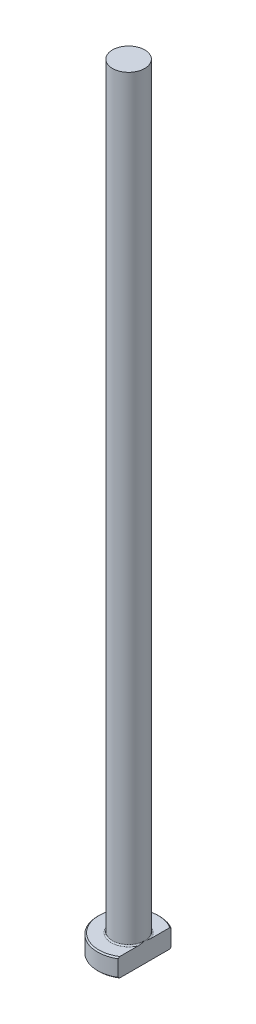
ISO-10303-21;
HEADER;
FILE_DESCRIPTION(('STEP AP214'),'2;1');
FILE_NAME('part.step','',(''),(''),'','','');
FILE_SCHEMA(('AUTOMOTIVE_DESIGN { 1 0 10303 214 1 1 1 1 }'));
ENDSEC;
DATA;
#1=APPLICATION_CONTEXT('core data for automotive mechanical design processes');
#2=APPLICATION_PROTOCOL_DEFINITION('international standard','automotive_design',2000,#1);
#3=PRODUCT_CONTEXT('',#1,'mechanical');
#4=PRODUCT('Part','Part','',(#3));
#5=PRODUCT_RELATED_PRODUCT_CATEGORY('part','',(#4));
#6=PRODUCT_DEFINITION_FORMATION('','',#4);
#7=PRODUCT_DEFINITION_CONTEXT('part definition',#1,'design');
#8=PRODUCT_DEFINITION('design','',#6,#7);
#9=PRODUCT_DEFINITION_SHAPE('','',#8);
#10=(LENGTH_UNIT() NAMED_UNIT(*) SI_UNIT(.MILLI.,.METRE.));
#11=(NAMED_UNIT(*) PLANE_ANGLE_UNIT() SI_UNIT($,.RADIAN.));
#12=(NAMED_UNIT(*) SI_UNIT($,.STERADIAN.) SOLID_ANGLE_UNIT());
#13=UNCERTAINTY_MEASURE_WITH_UNIT(LENGTH_MEASURE(1.E-05),#10,'distance_accuracy_value','');
#14=(GEOMETRIC_REPRESENTATION_CONTEXT(3) GLOBAL_UNCERTAINTY_ASSIGNED_CONTEXT((#13)) GLOBAL_UNIT_ASSIGNED_CONTEXT((#10,
#11,#12)) REPRESENTATION_CONTEXT('',''));
#15=CARTESIAN_POINT('',(0.,0.,0.));
#16=DIRECTION('',(0.,0.,1.));
#17=DIRECTION('',(1.,0.,0.));
#18=AXIS2_PLACEMENT_3D('',#15,#16,#17);
#19=CARTESIAN_POINT('',(0.,0.,0.));
#20=DIRECTION('',(0.,-1.,0.));
#21=DIRECTION('',(0.,0.,-1.));
#22=AXIS2_PLACEMENT_3D('',#19,#20,#21);
#23=PLANE('',#22);
#24=CARTESIAN_POINT('',(0.,0.,0.));
#25=DIRECTION('',(0.,-1.,0.));
#26=DIRECTION('',(0.,0.,-1.));
#27=AXIS2_PLACEMENT_3D('',#24,#25,#26);
#28=CIRCLE('',#27,4.79999999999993);
#29=CARTESIAN_POINT('',(2.59999999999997,0.,4.03484820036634));
#30=VERTEX_POINT('',#29);
#31=CARTESIAN_POINT('',(2.59999999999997,0.,-4.03484820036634));
#32=VERTEX_POINT('',#31);
#33=EDGE_CURVE('E98',#30,#32,#28,.T.);
#34=ORIENTED_EDGE('',*,*,#33,.T.);
#35=DIRECTION('',(0.,0.,1.));
#36=VECTOR('',#35,1.);
#37=CARTESIAN_POINT('',(2.59999999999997,0.,-4.27083130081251));
#38=LINE('',#37,#36);
#39=EDGE_CURVE('E83',#32,#30,#38,.T.);
#40=ORIENTED_EDGE('',*,*,#39,.T.);
#41=EDGE_LOOP('',(#34,#40));
#42=FACE_BOUND('',#41,.T.);
#43=ADVANCED_FACE('F32',(#42),#23,.T.);
#44=CARTESIAN_POINT('',(0.,259.958771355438,0.));
#45=DIRECTION('',(0.,1.,0.));
#46=DIRECTION('',(0.,0.,1.));
#47=AXIS2_PLACEMENT_3D('',#44,#45,#46);
#48=CYLINDRICAL_SURFACE('',#47,4.99999999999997);
#49=CARTESIAN_POINT('',(0.,2.80000000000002,0.));
#50=DIRECTION('',(0.,1.,0.));
#51=DIRECTION('',(0.,0.,1.));
#52=AXIS2_PLACEMENT_3D('',#49,#50,#51);
#53=CIRCLE('',#52,4.99999999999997);
#54=CARTESIAN_POINT('',(2.59999999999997,2.80000000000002,4.27083130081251));
#55=VERTEX_POINT('',#54);
#56=CARTESIAN_POINT('',(2.59999999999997,2.80000000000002,-4.27083130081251));
#57=VERTEX_POINT('',#56);
#58=EDGE_CURVE('E104',#55,#57,#53,.F.);
#59=ORIENTED_EDGE('',*,*,#58,.T.);
#60=DIRECTION('',(0.,-1.,0.));
#61=VECTOR('',#60,1.);
#62=CARTESIAN_POINT('',(2.59999999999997,125.,-4.27083130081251));
#63=LINE('',#62,#61);
#64=CARTESIAN_POINT('',(2.59999999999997,0.200000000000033,-4.27083130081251));
#65=VERTEX_POINT('',#64);
#66=EDGE_CURVE('E183',#57,#65,#63,.T.);
#67=ORIENTED_EDGE('',*,*,#66,.T.);
#68=CARTESIAN_POINT('',(0.,0.200000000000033,0.));
#69=DIRECTION('',(0.,-1.,0.));
#70=DIRECTION('',(0.,0.,-1.));
#71=AXIS2_PLACEMENT_3D('',#68,#69,#70);
#72=CIRCLE('',#71,4.99999999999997);
#73=CARTESIAN_POINT('',(2.59999999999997,0.200000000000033,4.27083130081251));
#74=VERTEX_POINT('',#73);
#75=EDGE_CURVE('E100',#65,#74,#72,.F.);
#76=ORIENTED_EDGE('',*,*,#75,.T.);
#77=DIRECTION('',(0.,-1.,0.));
#78=VECTOR('',#77,1.);
#79=CARTESIAN_POINT('',(2.59999999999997,125.,4.27083130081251));
#80=LINE('',#79,#78);
#81=EDGE_CURVE('E93',#55,#74,#80,.T.);
#82=ORIENTED_EDGE('',*,*,#81,.F.);
#83=EDGE_LOOP('',(#59,#67,#76,#82));
#84=FACE_BOUND('',#83,.T.);
#85=ADVANCED_FACE('F158',(#84),#48,.T.);
#86=CARTESIAN_POINT('',(-4.99999999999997,3.,0.));
#87=DIRECTION('',(0.,1.,0.));
#88=DIRECTION('',(0.,0.,1.));
#89=AXIS2_PLACEMENT_3D('',#86,#87,#88);
#90=PLANE('',#89);
#91=CARTESIAN_POINT('',(0.,3.,0.));
#92=DIRECTION('',(0.,1.,0.));
#93=DIRECTION('',(0.,0.,1.));
#94=AXIS2_PLACEMENT_3D('',#91,#92,#93);
#95=CIRCLE('',#94,4.79999999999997);
#96=CARTESIAN_POINT('',(2.59999999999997,3.,-4.03484820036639));
#97=VERTEX_POINT('',#96);
#98=CARTESIAN_POINT('',(2.59999999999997,3.,4.03484820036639));
#99=VERTEX_POINT('',#98);
#100=EDGE_CURVE('E178',#97,#99,#95,.T.);
#101=ORIENTED_EDGE('',*,*,#100,.T.);
#102=DIRECTION('',(0.,0.,-1.));
#103=VECTOR('',#102,1.);
#104=CARTESIAN_POINT('',(2.59999999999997,3.,0.));
#105=LINE('',#104,#103);
#106=CARTESIAN_POINT('',(2.59999999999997,2.99999999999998,1.03923048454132));
#107=VERTEX_POINT('',#106);
#108=EDGE_CURVE('E57',#99,#107,#105,.T.);
#109=ORIENTED_EDGE('',*,*,#108,.T.);
#110=CARTESIAN_POINT('',(0.,3.,0.));
#111=DIRECTION('',(0.,1.,0.));
#112=DIRECTION('',(0.,0.,1.));
#113=AXIS2_PLACEMENT_3D('',#110,#111,#112);
#114=CIRCLE('',#113,2.79999999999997);
#115=CARTESIAN_POINT('',(2.59999999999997,2.99999999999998,-1.03923048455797));
#116=VERTEX_POINT('',#115);
#117=EDGE_CURVE('E107',#107,#116,#114,.F.);
#118=ORIENTED_EDGE('',*,*,#117,.T.);
#119=EDGE_CURVE('E136',#116,#97,#105,.T.);
#120=ORIENTED_EDGE('',*,*,#119,.T.);
#121=EDGE_LOOP('',(#101,#109,#118,#120));
#122=FACE_BOUND('',#121,.T.);
#123=ADVANCED_FACE('F147',(#122),#90,.T.);
#124=CARTESIAN_POINT('',(0.,3.,0.));
#125=DIRECTION('',(0.,-1.,0.));
#126=DIRECTION('',(0.,0.,-1.));
#127=AXIS2_PLACEMENT_3D('',#124,#125,#126);
#128=CONICAL_SURFACE('',#127,4.79999999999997,0.785398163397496);
#129=ORIENTED_EDGE('',*,*,#58,.F.);
#130=CARTESIAN_POINT('',(2.59999999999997,-1.95047472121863,9.397433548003));
#131=CARTESIAN_POINT('',(2.59999999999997,-1.7601520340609,9.19995130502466));
#132=CARTESIAN_POINT('',(2.59999999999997,-1.57004107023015,9.0022644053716));
#133=CARTESIAN_POINT('',(2.59999999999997,-1.1903545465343,8.60637345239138));
#134=CARTESIAN_POINT('',(2.59999999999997,-1.00077899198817,8.40816939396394));
#135=CARTESIAN_POINT('',(2.59999999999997,-0.622208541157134,8.01106626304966));
#136=CARTESIAN_POINT('',(2.59999999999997,-0.433213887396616,7.81216695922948));
#137=CARTESIAN_POINT('',(2.59999999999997,-0.0560371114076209,7.41360059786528));
#138=CARTESIAN_POINT('',(2.59999999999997,0.132145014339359,7.21393354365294));
#139=CARTESIAN_POINT('',(2.59999999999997,0.504316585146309,6.81701377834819));
#140=CARTESIAN_POINT('',(2.59999999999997,0.688323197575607,6.61977717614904));
#141=CARTESIAN_POINT('',(2.59999999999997,1.05506202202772,6.22412305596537));
#142=CARTESIAN_POINT('',(2.59999999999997,1.23779424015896,6.02570554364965));
#143=CARTESIAN_POINT('',(2.59999999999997,1.60155525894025,5.62737135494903));
#144=CARTESIAN_POINT('',(2.59999999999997,1.7825843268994,5.42745492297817));
#145=CARTESIAN_POINT('',(2.59999999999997,2.14238277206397,5.02560172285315));
#146=CARTESIAN_POINT('',(2.59999999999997,2.32115220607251,4.82366500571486));
#147=CARTESIAN_POINT('',(2.59999999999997,2.62527031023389,4.4746966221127));
#148=CARTESIAN_POINT('',(2.59999999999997,2.75138938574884,4.32833728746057));
#149=CARTESIAN_POINT('',(2.59999999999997,3.00151582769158,4.03379615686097));
#150=CARTESIAN_POINT('',(2.59999999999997,3.12552298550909,3.88561418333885));
#151=CARTESIAN_POINT('',(2.59999999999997,3.37190002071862,3.58545728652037));
#152=CARTESIAN_POINT('',(2.59999999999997,3.49424212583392,3.43345946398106));
#153=CARTESIAN_POINT('',(2.59999999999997,3.73490070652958,3.12636139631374));
#154=CARTESIAN_POINT('',(2.59999999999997,3.85321820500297,2.97126195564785));
#155=CARTESIAN_POINT('',(2.59999999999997,4.08579009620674,2.65464223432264));
#156=CARTESIAN_POINT('',(2.59999999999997,4.19996477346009,2.49306256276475));
#157=CARTESIAN_POINT('',(2.59999999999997,4.36468341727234,2.24613590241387));
#158=CARTESIAN_POINT('',(2.59999999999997,4.41853818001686,2.16300143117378));
#159=CARTESIAN_POINT('',(2.59999999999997,4.52346182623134,1.99499855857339));
#160=CARTESIAN_POINT('',(2.59999999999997,4.574530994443,1.9101303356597));
#161=CARTESIAN_POINT('',(2.59999999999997,4.67263274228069,1.7393256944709));
#162=CARTESIAN_POINT('',(2.59999999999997,4.71970407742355,1.65341183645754));
#163=CARTESIAN_POINT('',(2.59999999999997,4.80952240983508,1.47936505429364));
#164=CARTESIAN_POINT('',(2.59999999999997,4.8522685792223,1.3912317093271));
#165=CARTESIAN_POINT('',(2.59999999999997,4.97211006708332,1.12354274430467));
#166=CARTESIAN_POINT('',(2.59999999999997,5.04118725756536,0.940070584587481));
#167=CARTESIAN_POINT('',(2.59999999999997,5.11752261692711,0.665284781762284));
#168=CARTESIAN_POINT('',(2.59999999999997,5.1380299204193,0.577624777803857));
#169=CARTESIAN_POINT('',(2.59999999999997,5.17073291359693,0.400736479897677));
#170=CARTESIAN_POINT('',(2.59999999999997,5.18292955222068,0.311508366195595));
#171=CARTESIAN_POINT('',(2.59999999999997,5.19813789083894,0.132628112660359));
#172=CARTESIAN_POINT('',(2.59999999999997,5.20118701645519,0.0429792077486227));
#173=CARTESIAN_POINT('',(2.59999999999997,5.19797827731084,-0.13615453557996));
#174=CARTESIAN_POINT('',(2.59999999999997,5.19171987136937,-0.225639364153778));
#175=CARTESIAN_POINT('',(2.59999999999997,5.17043196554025,-0.402893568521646));
#176=CARTESIAN_POINT('',(2.59999999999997,5.15546490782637,-0.490670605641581));
#177=CARTESIAN_POINT('',(2.59999999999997,5.11776551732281,-0.664523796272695));
#178=CARTESIAN_POINT('',(2.59999999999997,5.09503206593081,-0.750599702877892));
#179=CARTESIAN_POINT('',(2.59999999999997,5.04281440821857,-0.921261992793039));
#180=CARTESIAN_POINT('',(2.59999999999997,5.01328729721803,-1.00583506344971));
#181=CARTESIAN_POINT('',(2.59999999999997,4.94875799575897,-1.17281894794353));
#182=CARTESIAN_POINT('',(2.59999999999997,4.91375683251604,-1.25523016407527));
#183=CARTESIAN_POINT('',(2.59999999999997,4.80599778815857,-1.49096020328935));
#184=CARTESIAN_POINT('',(2.59999999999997,4.72750956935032,-1.64165062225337));
#185=CARTESIAN_POINT('',(2.59999999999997,4.55999715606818,-1.93711610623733));
#186=CARTESIAN_POINT('',(2.59999999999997,4.47096030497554,-2.08188377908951));
#187=CARTESIAN_POINT('',(2.59999999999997,4.28541544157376,-2.36729512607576));
#188=CARTESIAN_POINT('',(2.59999999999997,4.18888021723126,-2.50792095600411));
#189=CARTESIAN_POINT('',(2.59999999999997,3.99085344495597,-2.78550445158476));
#190=CARTESIAN_POINT('',(2.59999999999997,3.88936425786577,-2.92246381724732));
#191=CARTESIAN_POINT('',(2.59999999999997,3.68147097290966,-3.19533708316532));
#192=CARTESIAN_POINT('',(2.59999999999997,3.57502092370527,-3.3312158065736));
#193=CARTESIAN_POINT('',(2.59999999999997,3.35937457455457,-3.60078977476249));
#194=CARTESIAN_POINT('',(2.59999999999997,3.25017800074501,-3.7344847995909));
#195=CARTESIAN_POINT('',(2.59999999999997,3.02996614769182,-3.99983567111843));
#196=CARTESIAN_POINT('',(2.59999999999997,2.9189557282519,-4.1314955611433));
#197=CARTESIAN_POINT('',(2.59999999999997,2.69532568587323,-4.39344289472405));
#198=CARTESIAN_POINT('',(2.59999999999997,2.58270603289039,-4.52373031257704));
#199=CARTESIAN_POINT('',(2.59999999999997,2.28823888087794,-4.86104966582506));
#200=CARTESIAN_POINT('',(2.59999999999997,2.10540318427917,-5.06721827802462));
#201=CARTESIAN_POINT('',(2.59999999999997,1.73743041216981,-5.47749422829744));
#202=CARTESIAN_POINT('',(2.59999999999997,1.55229327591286,-5.68160151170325));
#203=CARTESIAN_POINT('',(2.59999999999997,1.18015264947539,-6.08844300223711));
#204=CARTESIAN_POINT('',(2.59999999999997,0.993147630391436,-6.29117580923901));
#205=CARTESIAN_POINT('',(2.59999999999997,0.617846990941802,-6.69544313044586));
#206=CARTESIAN_POINT('',(2.59999999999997,0.429551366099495,-6.89697764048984));
#207=CARTESIAN_POINT('',(2.59999999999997,0.0594707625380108,-7.29110398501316));
#208=CARTESIAN_POINT('',(2.59999999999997,-0.12227513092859,-7.48373254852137));
#209=CARTESIAN_POINT('',(2.59999999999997,-0.486506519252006,-7.86829020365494));
#210=CARTESIAN_POINT('',(2.59999999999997,-0.668992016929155,-8.06021929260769));
#211=CARTESIAN_POINT('',(2.59999999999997,-1.03436396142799,-8.44329936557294));
#212=CARTESIAN_POINT('',(2.59999999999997,-1.21724976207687,-8.63445096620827));
#213=CARTESIAN_POINT('',(2.59999999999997,-1.58351605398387,-9.01627657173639));
#214=CARTESIAN_POINT('',(2.59999999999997,-1.76689654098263,-9.20695058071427));
#215=CARTESIAN_POINT('',(2.59999999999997,-1.95047472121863,-9.397433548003));
#216=B_SPLINE_CURVE_WITH_KNOTS('',3,(#130,#131,#132,#133,#134,#135,#136,#137,#138,#139,#140,
#141,#142,#143,#144,#145,#146,#147,#148,#149,#150,#151,#152,#153,#154,#155,#156,#157,#158,#159,
#160,#161,#162,#163,#164,#165,#166,#167,#168,#169,#170,#171,#172,#173,#174,#175,#176,#177,#178,
#179,#180,#181,#182,#183,#184,#185,#186,#187,#188,#189,#190,#191,#192,#193,#194,#195,#196,#197,
#198,#199,#200,#201,#202,#203,#204,#205,#206,#207,#208,#209,#210,#211,#212,#213,#214,#215),
.UNSPECIFIED.,.F.,.F.,(4,2,2,2,2,2,2,2,2,2,2,2,2,2,2,2,2,2,2,2,2,2,2,2,2,2,2,2,2,2,2,2,2,2,2,2,
2,2,2,2,2,2,4),(0.,0.822799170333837,1.64560648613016,2.46872021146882,3.29183036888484,
4.10105194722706,4.91026964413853,5.71935814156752,6.5284262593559,7.10801764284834,
7.68766594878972,8.27296873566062,8.85812163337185,9.45143823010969,9.74855643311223,
10.0456442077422,10.3394095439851,10.6332310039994,11.2186835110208,11.4884410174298,
11.7581677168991,12.0267893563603,12.2954266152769,12.5621610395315,12.8289338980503,
13.0974401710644,13.3658961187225,13.8748906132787,14.3845021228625,14.896058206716,
15.4073728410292,15.9251595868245,16.4429981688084,16.9596236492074,17.4762587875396,
18.3029176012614,19.1295982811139,19.9570225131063,20.7844496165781,21.5789508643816,
22.3734551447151,23.1671010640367,23.9607401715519),.UNSPECIFIED.);
#217=EDGE_CURVE('E135',#55,#99,#216,.T.);
#218=ORIENTED_EDGE('',*,*,#217,.T.);
#219=ORIENTED_EDGE('',*,*,#100,.F.);
#220=EDGE_CURVE('E127',#97,#57,#216,.T.);
#221=ORIENTED_EDGE('',*,*,#220,.T.);
#222=EDGE_LOOP('',(#129,#218,#219,#221));
#223=FACE_BOUND('',#222,.T.);
#224=ADVANCED_FACE('F143',(#223),#128,.T.);
#225=CARTESIAN_POINT('',(0.,0.200000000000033,0.));
#226=DIRECTION('',(0.,1.,0.));
#227=DIRECTION('',(0.,0.,1.));
#228=AXIS2_PLACEMENT_3D('',#225,#226,#227);
#229=CONICAL_SURFACE('',#228,4.99999999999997,0.785398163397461);
#230=ORIENTED_EDGE('',*,*,#75,.F.);
#231=CARTESIAN_POINT('',(2.59999999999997,4.95047472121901,-9.397433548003));
#232=CARTESIAN_POINT('',(2.59999999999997,4.76015203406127,-9.19995130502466));
#233=CARTESIAN_POINT('',(2.59999999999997,4.5700410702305,-9.00226440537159));
#234=CARTESIAN_POINT('',(2.59999999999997,4.19035454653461,-8.60637345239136));
#235=CARTESIAN_POINT('',(2.59999999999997,4.00077899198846,-8.4081693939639));
#236=CARTESIAN_POINT('',(2.59999999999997,3.62220854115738,-8.01106626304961));
#237=CARTESIAN_POINT('',(2.59999999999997,3.43321388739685,-7.81216695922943));
#238=CARTESIAN_POINT('',(2.59999999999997,3.05603711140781,-7.41360059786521));
#239=CARTESIAN_POINT('',(2.59999999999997,2.86785498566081,-7.21393354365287));
#240=CARTESIAN_POINT('',(2.59999999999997,2.49568341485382,-6.8170137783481));
#241=CARTESIAN_POINT('',(2.59999999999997,2.31167680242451,-6.61977717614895));
#242=CARTESIAN_POINT('',(2.59999999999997,1.94493797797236,-6.22412305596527));
#243=CARTESIAN_POINT('',(2.59999999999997,1.7622057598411,-6.02570554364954));
#244=CARTESIAN_POINT('',(2.59999999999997,1.39844474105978,-5.6273713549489));
#245=CARTESIAN_POINT('',(2.59999999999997,1.21741567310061,-5.42745492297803));
#246=CARTESIAN_POINT('',(2.59999999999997,0.857617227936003,-5.025601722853));
#247=CARTESIAN_POINT('',(2.59999999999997,0.678847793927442,-4.8236650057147));
#248=CARTESIAN_POINT('',(2.59999999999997,0.374729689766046,-4.47469662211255));
#249=CARTESIAN_POINT('',(2.59999999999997,0.248610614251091,-4.32833728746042));
#250=CARTESIAN_POINT('',(2.59999999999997,-0.00151582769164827,-4.03379615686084));
#251=CARTESIAN_POINT('',(2.59999999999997,-0.125522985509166,-3.88561418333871));
#252=CARTESIAN_POINT('',(2.59999999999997,-0.371900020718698,-3.58545728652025));
#253=CARTESIAN_POINT('',(2.59999999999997,-0.494242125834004,-3.43345946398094));
#254=CARTESIAN_POINT('',(2.59999999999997,-0.734900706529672,-3.12636139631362));
#255=CARTESIAN_POINT('',(2.59999999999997,-0.853218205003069,-2.97126195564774));
#256=CARTESIAN_POINT('',(2.59999999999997,-1.08579009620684,-2.65464223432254));
#257=CARTESIAN_POINT('',(2.59999999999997,-1.1999647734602,-2.49306256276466));
#258=CARTESIAN_POINT('',(2.59999999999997,-1.36468341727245,-2.24613590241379));
#259=CARTESIAN_POINT('',(2.59999999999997,-1.41853818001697,-2.1630014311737));
#260=CARTESIAN_POINT('',(2.59999999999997,-1.52346182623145,-1.99499855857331));
#261=CARTESIAN_POINT('',(2.59999999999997,-1.57453099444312,-1.91013033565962));
#262=CARTESIAN_POINT('',(2.59999999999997,-1.6726327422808,-1.73932569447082));
#263=CARTESIAN_POINT('',(2.59999999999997,-1.71970407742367,-1.65341183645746));
#264=CARTESIAN_POINT('',(2.59999999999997,-1.8095224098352,-1.47936505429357));
#265=CARTESIAN_POINT('',(2.59999999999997,-1.85226857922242,-1.39123170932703));
#266=CARTESIAN_POINT('',(2.59999999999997,-1.97211006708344,-1.1235427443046));
#267=CARTESIAN_POINT('',(2.59999999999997,-2.04118725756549,-0.940070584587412));
#268=CARTESIAN_POINT('',(2.59999999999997,-2.11752261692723,-0.665284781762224));
#269=CARTESIAN_POINT('',(2.59999999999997,-2.13802992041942,-0.577624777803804));
#270=CARTESIAN_POINT('',(2.59999999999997,-2.17073291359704,-0.400736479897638));
#271=CARTESIAN_POINT('',(2.59999999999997,-2.18292955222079,-0.311508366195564));
#272=CARTESIAN_POINT('',(2.59999999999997,-2.19813789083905,-0.132628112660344));
#273=CARTESIAN_POINT('',(2.59999999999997,-2.2011870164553,-0.042979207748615));
#274=CARTESIAN_POINT('',(2.59999999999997,-2.19797827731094,0.136154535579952));
#275=CARTESIAN_POINT('',(2.59999999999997,-2.19171987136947,0.225639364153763));
#276=CARTESIAN_POINT('',(2.59999999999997,-2.17043196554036,0.402893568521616));
#277=CARTESIAN_POINT('',(2.59999999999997,-2.15546490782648,0.490670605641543));
#278=CARTESIAN_POINT('',(2.59999999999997,-2.11776551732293,0.664523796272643));
#279=CARTESIAN_POINT('',(2.59999999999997,-2.09503206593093,0.750599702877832));
#280=CARTESIAN_POINT('',(2.59999999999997,-2.04281440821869,0.921261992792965));
#281=CARTESIAN_POINT('',(2.59999999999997,-2.01328729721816,1.00583506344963));
#282=CARTESIAN_POINT('',(2.59999999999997,-1.9487579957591,1.17281894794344));
#283=CARTESIAN_POINT('',(2.59999999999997,-1.91375683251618,1.25523016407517));
#284=CARTESIAN_POINT('',(2.59999999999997,-1.80599778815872,1.49096020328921));
#285=CARTESIAN_POINT('',(2.59999999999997,-1.72750956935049,1.6416506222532));
#286=CARTESIAN_POINT('',(2.59999999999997,-1.55999715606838,1.9371161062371));
#287=CARTESIAN_POINT('',(2.59999999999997,-1.47096030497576,2.08188377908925));
#288=CARTESIAN_POINT('',(2.59999999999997,-1.28541544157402,2.36729512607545));
#289=CARTESIAN_POINT('',(2.59999999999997,-1.18888021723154,2.50792095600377));
#290=CARTESIAN_POINT('',(2.59999999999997,-0.990853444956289,2.78550445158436));
#291=CARTESIAN_POINT('',(2.59999999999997,-0.889364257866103,2.9224638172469));
#292=CARTESIAN_POINT('',(2.59999999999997,-0.681470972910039,3.19533708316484));
#293=CARTESIAN_POINT('',(2.59999999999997,-0.575020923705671,3.33121580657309));
#294=CARTESIAN_POINT('',(2.59999999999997,-0.359374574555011,3.60078977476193));
#295=CARTESIAN_POINT('',(2.59999999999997,-0.250178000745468,3.73448479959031));
#296=CARTESIAN_POINT('',(2.59999999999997,-0.0299661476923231,3.99983567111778));
#297=CARTESIAN_POINT('',(2.59999999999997,0.0810442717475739,4.13149556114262));
#298=CARTESIAN_POINT('',(2.59999999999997,0.304674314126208,4.39344289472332));
#299=CARTESIAN_POINT('',(2.59999999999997,0.417293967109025,4.52373031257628));
#300=CARTESIAN_POINT('',(2.59999999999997,0.711761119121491,4.86104966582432));
#301=CARTESIAN_POINT('',(2.59999999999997,0.894596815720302,5.06721827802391));
#302=CARTESIAN_POINT('',(2.59999999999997,1.26256958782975,5.47749422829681));
#303=CARTESIAN_POINT('',(2.59999999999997,1.44770672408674,5.68160151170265));
#304=CARTESIAN_POINT('',(2.59999999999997,1.8198473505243,6.08844300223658));
#305=CARTESIAN_POINT('',(2.59999999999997,2.0068523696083,6.29117580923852));
#306=CARTESIAN_POINT('',(2.59999999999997,2.38215300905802,6.69544313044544));
#307=CARTESIAN_POINT('',(2.59999999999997,2.57044863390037,6.89697764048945));
#308=CARTESIAN_POINT('',(2.59999999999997,2.94052923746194,7.29110398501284));
#309=CARTESIAN_POINT('',(2.59999999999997,3.12227513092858,7.48373254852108));
#310=CARTESIAN_POINT('',(2.59999999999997,3.48650651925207,7.86829020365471));
#311=CARTESIAN_POINT('',(2.59999999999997,3.66899201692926,8.06021929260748));
#312=CARTESIAN_POINT('',(2.59999999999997,4.03436396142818,8.44329936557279));
#313=CARTESIAN_POINT('',(2.59999999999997,4.2172497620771,8.63445096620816));
#314=CARTESIAN_POINT('',(2.59999999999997,4.58351605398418,9.01627657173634));
#315=CARTESIAN_POINT('',(2.59999999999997,4.76689654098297,9.20695058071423));
#316=CARTESIAN_POINT('',(2.59999999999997,4.95047472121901,9.397433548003));
#317=B_SPLINE_CURVE_WITH_KNOTS('',3,(#231,#232,#233,#234,#235,#236,#237,#238,#239,#240,#241,
#242,#243,#244,#245,#246,#247,#248,#249,#250,#251,#252,#253,#254,#255,#256,#257,#258,#259,#260,
#261,#262,#263,#264,#265,#266,#267,#268,#269,#270,#271,#272,#273,#274,#275,#276,#277,#278,#279,
#280,#281,#282,#283,#284,#285,#286,#287,#288,#289,#290,#291,#292,#293,#294,#295,#296,#297,#298,
#299,#300,#301,#302,#303,#304,#305,#306,#307,#308,#309,#310,#311,#312,#313,#314,#315,#316),
.UNSPECIFIED.,.F.,.F.,(4,2,2,2,2,2,2,2,2,2,2,2,2,2,2,2,2,2,2,2,2,2,2,2,2,2,2,2,2,2,2,2,2,2,2,2,
2,2,2,2,2,2,4),(0.,0.822799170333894,1.64560648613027,2.46872021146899,3.29183036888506,
4.10105194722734,4.91026964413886,5.71935814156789,6.52842625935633,7.10801764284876,
7.68766594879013,8.27296873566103,8.85812163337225,9.45143823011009,9.74855643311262,
10.0456442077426,10.3394095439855,10.6332310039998,11.2186835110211,11.4884410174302,
11.7581677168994,12.0267893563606,12.2954266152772,12.5621610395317,12.8289338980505,
13.0974401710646,13.3658961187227,13.8748906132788,14.3845021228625,14.8960582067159,
15.4073728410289,15.9251595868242,16.442998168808,16.9596236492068,17.476258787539,
18.3029176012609,19.1295982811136,19.9570225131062,20.7844496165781,21.5789508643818,
22.3734551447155,23.1671010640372,23.9607401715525),.UNSPECIFIED.);
#318=EDGE_CURVE('E86',#65,#32,#317,.T.);
#319=ORIENTED_EDGE('',*,*,#318,.T.);
#320=ORIENTED_EDGE('',*,*,#33,.F.);
#321=EDGE_CURVE('E89',#30,#74,#317,.T.);
#322=ORIENTED_EDGE('',*,*,#321,.T.);
#323=EDGE_LOOP('',(#230,#319,#320,#322));
#324=FACE_BOUND('',#323,.T.);
#325=ADVANCED_FACE('F97',(#324),#229,.T.);
#326=CARTESIAN_POINT('',(0.,3.19999999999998,0.));
#327=DIRECTION('',(0.,1.,0.));
#328=DIRECTION('',(0.,0.,1.));
#329=AXIS2_PLACEMENT_3D('',#326,#327,#328);
#330=TOROIDAL_SURFACE('',#329,2.79999999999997,0.2);
#331=CARTESIAN_POINT('',(2.59999999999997,3.19999999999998,0.));
#332=CARTESIAN_POINT('',(2.59999999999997,3.20000050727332,1.23579409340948E-10));
#333=CARTESIAN_POINT('',(2.59999999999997,3.20000101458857,-1.74789552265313E-07));
#334=CARTESIAN_POINT('',(2.59999999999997,3.20000196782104,-6.73287793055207E-07));
#335=CARTESIAN_POINT('',(2.59999999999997,3.20000240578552,-1.00747163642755E-06));
#336=CARTESIAN_POINT('',(2.59999999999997,3.20000330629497,-1.80604944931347E-06));
#337=CARTESIAN_POINT('',(2.59999999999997,3.20000375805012,-2.28310921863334E-06));
#338=CARTESIAN_POINT('',(2.59999999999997,3.20000457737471,-3.28018171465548E-06));
#339=CARTESIAN_POINT('',(2.59999999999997,3.20000494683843,-3.79874305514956E-06));
#340=CARTESIAN_POINT('',(2.59999999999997,3.20000629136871,-5.77594334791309E-06));
#341=CARTESIAN_POINT('',(2.59999999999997,3.20000719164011,-7.28765589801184E-06));
#342=CARTESIAN_POINT('',(2.59999999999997,3.20000869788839,-1.03067582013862E-05));
#343=CARTESIAN_POINT('',(2.59999999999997,3.20000932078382,-1.18060929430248E-05));
#344=CARTESIAN_POINT('',(2.59999999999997,3.20001188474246,-1.80612988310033E-05));
#345=CARTESIAN_POINT('',(2.59999999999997,3.20001376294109,-2.28467812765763E-05));
#346=CARTESIAN_POINT('',(2.59999999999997,3.20001657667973,-3.19530305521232E-05));
#347=CARTESIAN_POINT('',(2.59999999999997,3.20001760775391,-3.62442681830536E-05));
#348=CARTESIAN_POINT('',(2.59999999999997,3.20002504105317,-6.7868346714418E-05));
#349=CARTESIAN_POINT('',(2.59999999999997,3.20003059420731,-9.53536176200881E-05));
#350=CARTESIAN_POINT('',(2.59999999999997,3.20005490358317,-0.000203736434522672));
#351=CARTESIAN_POINT('',(2.59999999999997,3.20007818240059,-0.000283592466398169));
#352=CARTESIAN_POINT('',(2.59999999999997,3.2001686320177,-0.000599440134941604));
#353=CARTESIAN_POINT('',(2.59999999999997,3.2002328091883,-0.000836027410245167));
#354=CARTESIAN_POINT('',(2.59999999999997,3.20048945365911,-0.00177477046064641));
#355=CARTESIAN_POINT('',(2.59999999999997,3.20068565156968,-0.00247616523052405));
#356=CARTESIAN_POINT('',(2.59999999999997,3.20149940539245,-0.0053934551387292));
#357=CARTESIAN_POINT('',(2.59999999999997,3.20211229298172,-0.007610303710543));
#358=CARTESIAN_POINT('',(2.59999999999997,3.2076646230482,-0.0276831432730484));
#359=CARTESIAN_POINT('',(2.59999999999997,3.21262302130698,-0.0455354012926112));
#360=CARTESIAN_POINT('',(2.59999999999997,3.22230897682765,-0.0805439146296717));
#361=CARTESIAN_POINT('',(2.59999999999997,3.22703791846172,-0.0976998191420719));
#362=CARTESIAN_POINT('',(2.59999999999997,3.23705035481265,-0.134181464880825));
#363=CARTESIAN_POINT('',(2.59999999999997,3.2423287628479,-0.153508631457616));
#364=CARTESIAN_POINT('',(2.59999999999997,3.25286316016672,-0.192393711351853));
#365=CARTESIAN_POINT('',(2.59999999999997,3.25811828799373,-0.211951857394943));
#366=CARTESIAN_POINT('',(2.59999999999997,3.27070509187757,-0.259316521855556));
#367=CARTESIAN_POINT('',(2.59999999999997,3.27798202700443,-0.287137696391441));
#368=CARTESIAN_POINT('',(2.59999999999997,3.29204094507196,-0.342105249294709));
#369=CARTESIAN_POINT('',(2.59999999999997,3.29883098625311,-0.36924957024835));
#370=CARTESIAN_POINT('',(2.59999999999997,3.32069835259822,-0.459246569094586));
#371=CARTESIAN_POINT('',(2.59999999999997,3.33498012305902,-0.522296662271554));
#372=CARTESIAN_POINT('',(2.59999999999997,3.36056532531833,-0.649787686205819));
#373=CARTESIAN_POINT('',(2.59999999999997,3.37183254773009,-0.714236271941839));
#374=CARTESIAN_POINT('',(2.59999999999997,3.38542084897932,-0.81395858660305));
#375=CARTESIAN_POINT('',(2.59999999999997,3.38947199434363,-0.84899397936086));
#376=CARTESIAN_POINT('',(2.59999999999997,3.39578733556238,-0.91922149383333));
#377=CARTESIAN_POINT('',(2.59999999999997,3.39805216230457,-0.954413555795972));
#378=CARTESIAN_POINT('',(2.59999999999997,3.40031330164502,-1.02465521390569));
#379=CARTESIAN_POINT('',(2.59999999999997,3.40032384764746,-1.05970430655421));
#380=CARTESIAN_POINT('',(2.59999999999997,3.39745377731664,-1.1296713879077));
#381=CARTESIAN_POINT('',(2.59999999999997,3.39457726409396,-1.16458949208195));
#382=CARTESIAN_POINT('',(2.59999999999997,3.38762659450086,-1.21434358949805));
#383=CARTESIAN_POINT('',(2.59999999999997,3.3851418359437,-1.22940327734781));
#384=CARTESIAN_POINT('',(2.59999999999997,3.37928992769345,-1.25936829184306));
#385=CARTESIAN_POINT('',(2.59999999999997,3.37592199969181,-1.27427347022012));
#386=CARTESIAN_POINT('',(2.59999999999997,3.36819593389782,-1.30360801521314));
#387=CARTESIAN_POINT('',(2.59999999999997,3.36385215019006,-1.31804111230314));
#388=CARTESIAN_POINT('',(2.59999999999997,3.35394180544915,-1.34647366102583));
#389=CARTESIAN_POINT('',(2.59999999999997,3.34837682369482,-1.36047364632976));
#390=CARTESIAN_POINT('',(2.59999999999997,3.3378467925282,-1.3832098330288));
#391=CARTESIAN_POINT('',(2.59999999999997,3.33330355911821,-1.39214053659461));
#392=CARTESIAN_POINT('',(2.59999999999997,3.32341812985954,-1.40958482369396));
#393=CARTESIAN_POINT('',(2.59999999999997,3.31807401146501,-1.41809733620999));
#394=CARTESIAN_POINT('',(2.59999999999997,3.3064185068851,-1.43453575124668));
#395=CARTESIAN_POINT('',(2.59999999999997,3.30010038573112,-1.44245695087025));
#396=CARTESIAN_POINT('',(2.59999999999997,3.28637957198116,-1.45729976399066));
#397=CARTESIAN_POINT('',(2.59999999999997,3.27897945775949,-1.46422367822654));
#398=CARTESIAN_POINT('',(2.59999999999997,3.26567821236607,-1.47448129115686));
#399=CARTESIAN_POINT('',(2.59999999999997,3.26010727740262,-1.47824010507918));
#400=CARTESIAN_POINT('',(2.59999999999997,3.24845655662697,-1.48487520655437));
#401=CARTESIAN_POINT('',(2.59999999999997,3.24237710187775,-1.4877520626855));
#402=CARTESIAN_POINT('',(2.59999999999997,3.22972757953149,-1.49241784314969));
#403=CARTESIAN_POINT('',(2.59999999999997,3.22315282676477,-1.49419437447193));
#404=CARTESIAN_POINT('',(2.59999999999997,3.20978231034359,-1.49640812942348));
#405=CARTESIAN_POINT('',(2.59999999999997,3.20298682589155,-1.49684698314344));
#406=CARTESIAN_POINT('',(2.59999999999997,3.19037691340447,-1.49637060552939));
#407=CARTESIAN_POINT('',(2.59999999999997,3.18455503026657,-1.49563180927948));
#408=CARTESIAN_POINT('',(2.59999999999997,3.17311801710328,-1.49319000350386));
#409=CARTESIAN_POINT('',(2.59999999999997,3.1675030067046,-1.49148644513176));
#410=CARTESIAN_POINT('',(2.59999999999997,3.15514195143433,-1.48668054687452));
#411=CARTESIAN_POINT('',(2.59999999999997,3.14849468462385,-1.48332605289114));
#412=CARTESIAN_POINT('',(2.59999999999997,3.13582833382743,-1.47559145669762));
#413=CARTESIAN_POINT('',(2.59999999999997,3.12981053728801,-1.47120930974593));
#414=CARTESIAN_POINT('',(2.59999999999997,3.11535552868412,-1.45914343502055));
#415=CARTESIAN_POINT('',(2.59999999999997,3.10734855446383,-1.45094839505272));
#416=CARTESIAN_POINT('',(2.59999999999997,3.09265977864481,-1.43346680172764));
#417=CARTESIAN_POINT('',(2.59999999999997,3.08598026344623,-1.4241784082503));
#418=CARTESIAN_POINT('',(2.59999999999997,3.06857102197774,-1.39681642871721));
#419=CARTESIAN_POINT('',(2.59999999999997,3.05915220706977,-1.37791719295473));
#420=CARTESIAN_POINT('',(2.59999999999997,3.04297062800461,-1.3389290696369));
#421=CARTESIAN_POINT('',(2.59999999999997,3.03622846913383,-1.31883227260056));
#422=CARTESIAN_POINT('',(2.59999999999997,3.02432998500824,-1.27632728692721));
#423=CARTESIAN_POINT('',(2.59999999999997,3.01935848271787,-1.25386836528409));
#424=CARTESIAN_POINT('',(2.59999999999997,3.01130018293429,-1.20858750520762));
#425=CARTESIAN_POINT('',(2.59999999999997,3.00821705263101,-1.18576494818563));
#426=CARTESIAN_POINT('',(2.59999999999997,3.00363796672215,-1.1405967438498));
#427=CARTESIAN_POINT('',(2.59999999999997,3.00210096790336,-1.11825509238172));
#428=CARTESIAN_POINT('',(2.59999999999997,3.00022491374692,-1.07361049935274));
#429=CARTESIAN_POINT('',(2.59999999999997,2.99988136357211,-1.05130772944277));
#430=CARTESIAN_POINT('',(2.59999999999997,3.00029323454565,-0.991792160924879));
#431=CARTESIAN_POINT('',(2.59999999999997,3.00193756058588,-0.954585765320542));
#432=CARTESIAN_POINT('',(2.59999999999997,3.00736147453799,-0.880345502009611));
#433=CARTESIAN_POINT('',(2.59999999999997,3.01114096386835,-0.843311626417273));
#434=CARTESIAN_POINT('',(2.59999999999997,3.02049059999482,-0.768589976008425));
#435=CARTESIAN_POINT('',(2.59999999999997,3.02610078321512,-0.730907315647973));
#436=CARTESIAN_POINT('',(2.59999999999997,3.0387231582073,-0.655686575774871));
#437=CARTESIAN_POINT('',(2.59999999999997,3.0457387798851,-0.618149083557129));
#438=CARTESIAN_POINT('',(2.59999999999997,3.06358120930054,-0.52980872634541));
#439=CARTESIAN_POINT('',(2.59999999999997,3.07487037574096,-0.479100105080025));
#440=CARTESIAN_POINT('',(2.59999999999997,3.09870164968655,-0.378576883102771));
#441=CARTESIAN_POINT('',(2.59999999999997,3.1112285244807,-0.328758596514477));
#442=CARTESIAN_POINT('',(2.59999999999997,3.13564556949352,-0.234990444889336));
#443=CARTESIAN_POINT('',(2.59999999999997,3.14744634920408,-0.191016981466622));
#444=CARTESIAN_POINT('',(2.59999999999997,3.17192746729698,-0.101304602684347));
#445=CARTESIAN_POINT('',(2.59999999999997,3.18462387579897,-0.0555700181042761));
#446=CARTESIAN_POINT('',(2.59999999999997,3.19788889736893,-0.00760560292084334));
#447=CARTESIAN_POINT('',(2.59999999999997,3.19850316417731,-0.00538409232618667));
#448=CARTESIAN_POINT('',(2.59999999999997,3.19931724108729,-0.00246573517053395));
#449=CARTESIAN_POINT('',(2.59999999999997,3.19951242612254,-0.00176794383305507));
#450=CARTESIAN_POINT('',(2.59999999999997,3.19976783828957,-0.000833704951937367));
#451=CARTESIAN_POINT('',(2.59999999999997,3.19983177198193,-0.000598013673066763));
#452=CARTESIAN_POINT('',(2.59999999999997,3.19992192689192,-0.000283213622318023));
#453=CARTESIAN_POINT('',(2.59999999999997,3.19994516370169,-0.00020351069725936));
#454=CARTESIAN_POINT('',(2.59999999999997,3.19996943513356,-9.53048357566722E-05));
#455=CARTESIAN_POINT('',(2.59999999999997,3.19997498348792,-6.78414250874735E-05));
#456=CARTESIAN_POINT('',(2.59999999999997,3.1999824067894,-3.62395621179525E-05));
#457=CARTESIAN_POINT('',(2.59999999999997,3.19998343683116,-3.19495761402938E-05));
#458=CARTESIAN_POINT('',(2.59999999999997,3.19998624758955,-2.2845859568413E-05));
#459=CARTESIAN_POINT('',(2.59999999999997,3.19998812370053,-1.80615919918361E-05));
#460=CARTESIAN_POINT('',(2.59999999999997,3.19999068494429,-1.18076342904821E-05));
#461=CARTESIAN_POINT('',(2.59999999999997,3.19999130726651,-1.03083932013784E-05));
#462=CARTESIAN_POINT('',(2.59999999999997,3.19999281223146,-7.28938063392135E-06));
#463=CARTESIAN_POINT('',(2.59999999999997,3.19999371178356,-5.77765312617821E-06));
#464=CARTESIAN_POINT('',(2.59999999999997,3.19999505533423,-3.80031827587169E-06));
#465=CARTESIAN_POINT('',(2.59999999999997,3.19999542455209,-3.28169096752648E-06));
#466=CARTESIAN_POINT('',(2.59999999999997,3.19999624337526,-2.28444217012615E-06));
#467=CARTESIAN_POINT('',(2.59999999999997,3.19999669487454,-1.80727069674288E-06));
#468=CARTESIAN_POINT('',(2.59999999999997,3.19999759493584,-1.00842880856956E-06));
#469=CARTESIAN_POINT('',(2.59999999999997,3.19999803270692,-6.74101888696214E-07));
#470=CARTESIAN_POINT('',(2.59999999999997,3.19999898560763,-1.75245051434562E-07));
#471=CARTESIAN_POINT('',(2.59999999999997,3.19999949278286,-1.23565714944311E-10));
#472=CARTESIAN_POINT('',(2.59999999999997,3.19999999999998,0.));
#473=B_SPLINE_CURVE_WITH_KNOTS('',3,(#331,#332,#333,#334,#335,#336,#337,#338,#339,#340,#341,
#342,#343,#344,#345,#346,#347,#348,#349,#350,#351,#352,#353,#354,#355,#356,#357,#358,#359,#360,
#361,#362,#363,#364,#365,#366,#367,#368,#369,#370,#371,#372,#373,#374,#375,#376,#377,#378,#379,
#380,#381,#382,#383,#384,#385,#386,#387,#388,#389,#390,#391,#392,#393,#394,#395,#396,#397,#398,
#399,#400,#401,#402,#403,#404,#405,#406,#407,#408,#409,#410,#411,#412,#413,#414,#415,#416,#417,
#418,#419,#420,#421,#422,#423,#424,#425,#426,#427,#428,#429,#430,#431,#432,#433,#434,#435,#436,
#437,#438,#439,#440,#441,#442,#443,#444,#445,#446,#447,#448,#449,#450,#451,#452,#453,#454,#455,
#456,#457,#458,#459,#460,#461,#462,#463,#464,#465,#466,#467,#468,#469,#470,#471,#472),
.UNSPECIFIED.,.T.,.F.,(4,2,2,2,2,2,2,2,2,2,2,2,2,2,2,2,2,2,2,2,2,2,2,2,2,2,2,2,2,2,2,2,2,2,2,2,
2,2,2,2,2,2,2,2,2,2,2,2,2,2,2,2,2,2,2,2,2,2,2,2,2,2,2,2,2,2,2,2,2,2,4),(0.,1.53042757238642E-06,
3.18106748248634E-06,5.14121990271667E-06,7.05005828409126E-06,1.23079983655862E-05,
1.7174539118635E-05,3.25667081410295E-05,4.57900795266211E-05,0.00012992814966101,
0.00037919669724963,0.00111488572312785,0.00329950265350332,0.0101999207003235,
0.0657821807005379,0.119169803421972,0.179274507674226,0.24002995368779,0.326299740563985,
0.410240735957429,0.6041400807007,0.800273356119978,0.906045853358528,1.01178097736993,
1.1168484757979,1.22176686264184,1.26753679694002,1.31334720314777,1.35852340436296,
1.40364152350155,1.43367014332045,1.46377203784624,1.49409227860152,1.52434140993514,
1.54444068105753,1.56452696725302,1.58483555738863,1.6051193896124,1.62263810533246,
1.64016679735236,1.66238011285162,1.6846380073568,1.71881594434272,1.75305224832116,
1.81604715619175,1.87951801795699,1.94841441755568,2.01744419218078,2.08458891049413,
2.15148046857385,2.26311962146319,2.37475362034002,2.48901400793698,2.60355671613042,
2.75937570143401,2.91347192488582,3.0500585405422,3.19244561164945,3.19936059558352,
3.20153398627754,3.20226688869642,3.20251568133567,3.2025997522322,3.20261297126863,
3.20262835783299,3.20263322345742,3.20263848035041,3.20264038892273,3.2026423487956,
3.20264399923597,3.20264552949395),.UNSPECIFIED.);
#474=CARTESIAN_POINT('',(2.59999999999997,3.19999999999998,0.));
#475=VERTEX_POINT('',#474);
#476=EDGE_CURVE('E11',#116,#475,#473,.T.);
#477=ORIENTED_EDGE('',*,*,#476,.F.);
#478=ORIENTED_EDGE('',*,*,#117,.F.);
#479=CARTESIAN_POINT('',(2.59999999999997,3.19999999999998,0.));
#480=CARTESIAN_POINT('',(2.59999999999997,3.19999949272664,-1.23579435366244E-10));
#481=CARTESIAN_POINT('',(2.59999999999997,3.19999898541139,1.74789552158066E-07));
#482=CARTESIAN_POINT('',(2.59999999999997,3.19999803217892,6.73287792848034E-07));
#483=CARTESIAN_POINT('',(2.59999999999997,3.19999759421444,1.00747163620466E-06));
#484=CARTESIAN_POINT('',(2.59999999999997,3.19999669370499,1.80604944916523E-06));
#485=CARTESIAN_POINT('',(2.59999999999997,3.19999624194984,2.28310921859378E-06));
#486=CARTESIAN_POINT('',(2.59999999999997,3.19999542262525,3.28018171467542E-06));
#487=CARTESIAN_POINT('',(2.59999999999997,3.19999505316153,3.79874305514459E-06));
#488=CARTESIAN_POINT('',(2.59999999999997,3.19999370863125,5.77594334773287E-06));
#489=CARTESIAN_POINT('',(2.59999999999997,3.19999280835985,7.28765589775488E-06));
#490=CARTESIAN_POINT('',(2.59999999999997,3.19999130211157,1.03067582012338E-05));
#491=CARTESIAN_POINT('',(2.59999999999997,3.19999067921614,1.18060929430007E-05));
#492=CARTESIAN_POINT('',(2.59999999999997,3.1999881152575,1.80612988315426E-05));
#493=CARTESIAN_POINT('',(2.59999999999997,3.19998623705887,2.28467812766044E-05));
#494=CARTESIAN_POINT('',(2.59999999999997,3.19998342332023,3.19530305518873E-05));
#495=CARTESIAN_POINT('',(2.59999999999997,3.19998239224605,3.62442681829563E-05));
#496=CARTESIAN_POINT('',(2.59999999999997,3.19997495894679,6.78683467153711E-05));
#497=CARTESIAN_POINT('',(2.59999999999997,3.19996940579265,9.53536176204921E-05));
#498=CARTESIAN_POINT('',(2.59999999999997,3.19994509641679,0.000203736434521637));
#499=CARTESIAN_POINT('',(2.59999999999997,3.19992181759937,0.000283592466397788));
#500=CARTESIAN_POINT('',(2.59999999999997,3.19983136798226,0.000599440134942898));
#501=CARTESIAN_POINT('',(2.59999999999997,3.19976719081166,0.000836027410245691));
#502=CARTESIAN_POINT('',(2.59999999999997,3.19951054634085,0.00177477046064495));
#503=CARTESIAN_POINT('',(2.59999999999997,3.19931434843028,0.00247616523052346));
#504=CARTESIAN_POINT('',(2.59999999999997,3.19850059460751,0.00539345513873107));
#505=CARTESIAN_POINT('',(2.59999999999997,3.19788770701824,0.00761030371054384));
#506=CARTESIAN_POINT('',(2.59999999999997,3.19233537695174,0.0276831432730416));
#507=CARTESIAN_POINT('',(2.59999999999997,3.18737697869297,0.0455354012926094));
#508=CARTESIAN_POINT('',(2.59999999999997,3.17769102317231,0.0805439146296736));
#509=CARTESIAN_POINT('',(2.59999999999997,3.17296208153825,0.0976998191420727));
#510=CARTESIAN_POINT('',(2.59999999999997,3.16294964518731,0.134181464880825));
#511=CARTESIAN_POINT('',(2.59999999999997,3.15767123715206,0.153508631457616));
#512=CARTESIAN_POINT('',(2.59999999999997,3.14713683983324,0.192393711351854));
#513=CARTESIAN_POINT('',(2.59999999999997,3.14188171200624,0.211951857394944));
#514=CARTESIAN_POINT('',(2.59999999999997,3.12929490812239,0.259316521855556));
#515=CARTESIAN_POINT('',(2.59999999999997,3.12201797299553,0.287137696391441));
#516=CARTESIAN_POINT('',(2.59999999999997,3.107959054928,0.342105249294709));
#517=CARTESIAN_POINT('',(2.59999999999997,3.10116901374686,0.36924957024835));
#518=CARTESIAN_POINT('',(2.59999999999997,3.07930164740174,0.459246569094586));
#519=CARTESIAN_POINT('',(2.59999999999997,3.06501987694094,0.522296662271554));
#520=CARTESIAN_POINT('',(2.59999999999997,3.03943467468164,0.649787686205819));
#521=CARTESIAN_POINT('',(2.59999999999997,3.02816745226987,0.714236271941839));
#522=CARTESIAN_POINT('',(2.59999999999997,3.01457915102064,0.81395858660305));
#523=CARTESIAN_POINT('',(2.59999999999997,3.01052800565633,0.84899397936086));
#524=CARTESIAN_POINT('',(2.59999999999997,3.00421266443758,0.91922149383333));
#525=CARTESIAN_POINT('',(2.59999999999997,3.00194783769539,0.954413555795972));
#526=CARTESIAN_POINT('',(2.59999999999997,2.99968669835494,1.02465521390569));
#527=CARTESIAN_POINT('',(2.59999999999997,2.9996761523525,1.05970430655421));
#528=CARTESIAN_POINT('',(2.59999999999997,3.00254622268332,1.1296713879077));
#529=CARTESIAN_POINT('',(2.59999999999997,3.005422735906,1.16458949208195));
#530=CARTESIAN_POINT('',(2.59999999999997,3.0123734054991,1.21434358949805));
#531=CARTESIAN_POINT('',(2.59999999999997,3.01485816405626,1.22940327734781));
#532=CARTESIAN_POINT('',(2.59999999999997,3.02071007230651,1.25936829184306));
#533=CARTESIAN_POINT('',(2.59999999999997,3.02407800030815,1.27427347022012));
#534=CARTESIAN_POINT('',(2.59999999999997,3.03180406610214,1.30360801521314));
#535=CARTESIAN_POINT('',(2.59999999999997,3.0361478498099,1.31804111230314));
#536=CARTESIAN_POINT('',(2.59999999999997,3.04605819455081,1.34647366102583));
#537=CARTESIAN_POINT('',(2.59999999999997,3.05162317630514,1.36047364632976));
#538=CARTESIAN_POINT('',(2.59999999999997,3.06215320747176,1.3832098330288));
#539=CARTESIAN_POINT('',(2.59999999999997,3.06669644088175,1.39214053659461));
#540=CARTESIAN_POINT('',(2.59999999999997,3.07658187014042,1.40958482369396));
#541=CARTESIAN_POINT('',(2.59999999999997,3.08192598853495,1.41809733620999));
#542=CARTESIAN_POINT('',(2.59999999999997,3.09358149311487,1.43453575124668));
#543=CARTESIAN_POINT('',(2.59999999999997,3.09989961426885,1.44245695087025));
#544=CARTESIAN_POINT('',(2.59999999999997,3.11362042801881,1.45729976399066));
#545=CARTESIAN_POINT('',(2.59999999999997,3.12102054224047,1.46422367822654));
#546=CARTESIAN_POINT('',(2.59999999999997,3.13432178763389,1.47448129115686));
#547=CARTESIAN_POINT('',(2.59999999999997,3.13989272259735,1.47824010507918));
#548=CARTESIAN_POINT('',(2.59999999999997,3.15154344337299,1.48487520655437));
#549=CARTESIAN_POINT('',(2.59999999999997,3.15762289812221,1.4877520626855));
#550=CARTESIAN_POINT('',(2.59999999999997,3.17027242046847,1.49241784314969));
#551=CARTESIAN_POINT('',(2.59999999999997,3.17684717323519,1.49419437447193));
#552=CARTESIAN_POINT('',(2.59999999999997,3.19021768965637,1.49640812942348));
#553=CARTESIAN_POINT('',(2.59999999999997,3.19701317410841,1.49684698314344));
#554=CARTESIAN_POINT('',(2.59999999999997,3.20962308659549,1.49637060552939));
#555=CARTESIAN_POINT('',(2.59999999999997,3.21544496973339,1.49563180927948));
#556=CARTESIAN_POINT('',(2.59999999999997,3.22688198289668,1.49319000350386));
#557=CARTESIAN_POINT('',(2.59999999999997,3.23249699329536,1.49148644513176));
#558=CARTESIAN_POINT('',(2.59999999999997,3.24485804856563,1.48668054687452));
#559=CARTESIAN_POINT('',(2.59999999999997,3.25150531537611,1.48332605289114));
#560=CARTESIAN_POINT('',(2.59999999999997,3.26417166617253,1.47559145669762));
#561=CARTESIAN_POINT('',(2.59999999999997,3.27018946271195,1.47120930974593));
#562=CARTESIAN_POINT('',(2.59999999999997,3.28464447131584,1.45914343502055));
#563=CARTESIAN_POINT('',(2.59999999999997,3.29265144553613,1.45094839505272));
#564=CARTESIAN_POINT('',(2.59999999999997,3.30734022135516,1.43346680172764));
#565=CARTESIAN_POINT('',(2.59999999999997,3.31401973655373,1.4241784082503));
#566=CARTESIAN_POINT('',(2.59999999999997,3.33142897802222,1.39681642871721));
#567=CARTESIAN_POINT('',(2.59999999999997,3.34084779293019,1.37791719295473));
#568=CARTESIAN_POINT('',(2.59999999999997,3.35702937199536,1.3389290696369));
#569=CARTESIAN_POINT('',(2.59999999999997,3.36377153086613,1.31883227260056));
#570=CARTESIAN_POINT('',(2.59999999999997,3.37567001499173,1.27632728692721));
#571=CARTESIAN_POINT('',(2.59999999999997,3.38064151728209,1.25386836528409));
#572=CARTESIAN_POINT('',(2.59999999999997,3.38869981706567,1.20858750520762));
#573=CARTESIAN_POINT('',(2.59999999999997,3.39178294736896,1.18576494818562));
#574=CARTESIAN_POINT('',(2.59999999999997,3.39636203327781,1.1405967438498));
#575=CARTESIAN_POINT('',(2.59999999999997,3.39789903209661,1.11825509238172));
#576=CARTESIAN_POINT('',(2.59999999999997,3.39977508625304,1.07361049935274));
#577=CARTESIAN_POINT('',(2.59999999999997,3.40011863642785,1.05130772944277));
#578=CARTESIAN_POINT('',(2.59999999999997,3.39970676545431,0.991792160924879));
#579=CARTESIAN_POINT('',(2.59999999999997,3.39806243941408,0.954585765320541));
#580=CARTESIAN_POINT('',(2.59999999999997,3.39263852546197,0.880345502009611));
#581=CARTESIAN_POINT('',(2.59999999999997,3.38885903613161,0.843311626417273));
#582=CARTESIAN_POINT('',(2.59999999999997,3.37950940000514,0.768589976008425));
#583=CARTESIAN_POINT('',(2.59999999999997,3.37389921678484,0.730907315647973));
#584=CARTESIAN_POINT('',(2.59999999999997,3.36127684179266,0.655686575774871));
#585=CARTESIAN_POINT('',(2.59999999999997,3.35426122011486,0.618149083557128));
#586=CARTESIAN_POINT('',(2.59999999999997,3.33641879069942,0.52980872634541));
#587=CARTESIAN_POINT('',(2.59999999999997,3.325129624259,0.479100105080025));
#588=CARTESIAN_POINT('',(2.59999999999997,3.30129835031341,0.378576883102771));
#589=CARTESIAN_POINT('',(2.59999999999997,3.28877147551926,0.328758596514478));
#590=CARTESIAN_POINT('',(2.59999999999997,3.26435443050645,0.234990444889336));
#591=CARTESIAN_POINT('',(2.59999999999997,3.25255365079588,0.19101698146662));
#592=CARTESIAN_POINT('',(2.59999999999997,3.22807253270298,0.101304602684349));
#593=CARTESIAN_POINT('',(2.59999999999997,3.21537612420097,0.0555700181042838));
#594=CARTESIAN_POINT('',(2.59999999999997,3.20211110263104,0.007605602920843));
#595=CARTESIAN_POINT('',(2.59999999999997,3.20149683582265,0.00538409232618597));
#596=CARTESIAN_POINT('',(2.59999999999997,3.20068275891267,0.00246573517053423));
#597=CARTESIAN_POINT('',(2.59999999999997,3.20048757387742,0.00176794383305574));
#598=CARTESIAN_POINT('',(2.59999999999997,3.20023216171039,0.000833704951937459));
#599=CARTESIAN_POINT('',(2.59999999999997,3.20016822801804,0.000598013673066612));
#600=CARTESIAN_POINT('',(2.59999999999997,3.20007807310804,0.000283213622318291));
#601=CARTESIAN_POINT('',(2.59999999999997,3.20005483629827,0.000203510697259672));
#602=CARTESIAN_POINT('',(2.59999999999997,3.20003056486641,9.53048357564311E-05));
#603=CARTESIAN_POINT('',(2.59999999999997,3.20002501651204,6.78414250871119E-05));
#604=CARTESIAN_POINT('',(2.59999999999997,3.20001759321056,3.62395621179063E-05));
#605=CARTESIAN_POINT('',(2.59999999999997,3.2000165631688,3.19495761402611E-05));
#606=CARTESIAN_POINT('',(2.59999999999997,3.20001375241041,2.28458595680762E-05));
#607=CARTESIAN_POINT('',(2.59999999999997,3.20001187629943,1.80615919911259E-05));
#608=CARTESIAN_POINT('',(2.59999999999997,3.20000931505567,1.18076342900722E-05));
#609=CARTESIAN_POINT('',(2.59999999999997,3.20000869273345,1.03083932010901E-05));
#610=CARTESIAN_POINT('',(2.59999999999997,3.2000071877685,7.28938063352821E-06));
#611=CARTESIAN_POINT('',(2.59999999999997,3.2000062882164,5.77765312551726E-06));
#612=CARTESIAN_POINT('',(2.59999999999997,3.20000494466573,3.80031827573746E-06));
#613=CARTESIAN_POINT('',(2.59999999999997,3.20000457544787,3.28169096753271E-06));
#614=CARTESIAN_POINT('',(2.59999999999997,3.2000037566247,2.28444217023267E-06));
#615=CARTESIAN_POINT('',(2.59999999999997,3.20000330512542,1.80727069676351E-06));
#616=CARTESIAN_POINT('',(2.59999999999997,3.20000240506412,1.00842880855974E-06));
#617=CARTESIAN_POINT('',(2.59999999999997,3.20000196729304,6.7410188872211E-07));
#618=CARTESIAN_POINT('',(2.59999999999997,3.20000101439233,1.75245051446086E-07));
#619=CARTESIAN_POINT('',(2.59999999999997,3.20000050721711,1.23565740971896E-10));
#620=CARTESIAN_POINT('',(2.59999999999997,3.19999999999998,0.));
#621=B_SPLINE_CURVE_WITH_KNOTS('',3,(#479,#480,#481,#482,#483,#484,#485,#486,#487,#488,#489,
#490,#491,#492,#493,#494,#495,#496,#497,#498,#499,#500,#501,#502,#503,#504,#505,#506,#507,#508,
#509,#510,#511,#512,#513,#514,#515,#516,#517,#518,#519,#520,#521,#522,#523,#524,#525,#526,#527,
#528,#529,#530,#531,#532,#533,#534,#535,#536,#537,#538,#539,#540,#541,#542,#543,#544,#545,#546,
#547,#548,#549,#550,#551,#552,#553,#554,#555,#556,#557,#558,#559,#560,#561,#562,#563,#564,#565,
#566,#567,#568,#569,#570,#571,#572,#573,#574,#575,#576,#577,#578,#579,#580,#581,#582,#583,#584,
#585,#586,#587,#588,#589,#590,#591,#592,#593,#594,#595,#596,#597,#598,#599,#600,#601,#602,#603,
#604,#605,#606,#607,#608,#609,#610,#611,#612,#613,#614,#615,#616,#617,#618,#619,#620),
.UNSPECIFIED.,.T.,.F.,(4,2,2,2,2,2,2,2,2,2,2,2,2,2,2,2,2,2,2,2,2,2,2,2,2,2,2,2,2,2,2,2,2,2,2,2,
2,2,2,2,2,2,2,2,2,2,2,2,2,2,2,2,2,2,2,2,2,2,2,2,2,2,2,2,2,2,2,2,2,2,4),(0.,1.53042757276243E-06,
3.18106748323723E-06,5.14121990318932E-06,7.05005828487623E-06,1.23079983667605E-05,
1.71745391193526E-05,3.25667081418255E-05,4.57900795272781E-05,0.000129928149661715,
0.000379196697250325,0.00111488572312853,0.00329950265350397,0.0101999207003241,
0.0657821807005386,0.119169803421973,0.179274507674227,0.240029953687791,0.326299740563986,
0.41024073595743,0.604140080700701,0.800273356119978,0.906045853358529,1.01178097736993,
1.1168484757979,1.22176686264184,1.26753679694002,1.31334720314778,1.35852340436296,
1.40364152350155,1.43367014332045,1.46377203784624,1.49409227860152,1.52434140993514,
1.54444068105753,1.56452696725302,1.58483555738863,1.6051193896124,1.62263810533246,
1.64016679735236,1.66238011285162,1.6846380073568,1.71881594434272,1.75305224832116,
1.81604715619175,1.87951801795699,1.94841441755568,2.01744419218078,2.08458891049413,
2.15148046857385,2.26311962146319,2.37475362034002,2.48901400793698,2.60355671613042,
2.75937570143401,2.91347192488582,3.0500585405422,3.19244561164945,3.19936059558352,
3.20153398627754,3.20226688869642,3.20251568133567,3.2025997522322,3.20261297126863,
3.20262835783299,3.20263322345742,3.20263848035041,3.20264038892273,3.2026423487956,
3.20264399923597,3.20264552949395),.UNSPECIFIED.);
#622=EDGE_CURVE('E46',#475,#107,#621,.T.);
#623=ORIENTED_EDGE('',*,*,#622,.F.);
#624=CARTESIAN_POINT('',(0.,3.19999999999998,0.));
#625=DIRECTION('',(0.,1.,0.));
#626=DIRECTION('',(0.,0.,1.));
#627=AXIS2_PLACEMENT_3D('',#624,#625,#626);
#628=CIRCLE('',#627,2.59999999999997);
#629=EDGE_CURVE('E103',#475,#475,#628,.T.);
#630=ORIENTED_EDGE('',*,*,#629,.F.);
#631=EDGE_LOOP('',(#477,#478,#623,#630));
#632=FACE_BOUND('',#631,.T.);
#633=ADVANCED_FACE('F34',(#632),#330,.F.);
#634=CARTESIAN_POINT('',(0.,259.958771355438,0.));
#635=DIRECTION('',(0.,1.,0.));
#636=DIRECTION('',(0.,0.,1.));
#637=AXIS2_PLACEMENT_3D('',#634,#635,#636);
#638=CYLINDRICAL_SURFACE('',#637,2.59999999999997);
#639=ORIENTED_EDGE('',*,*,#629,.T.);
#640=EDGE_LOOP('',(#639));
#641=FACE_BOUND('',#640,.T.);
#642=CARTESIAN_POINT('',(0.,125.,0.));
#643=DIRECTION('',(0.,1.,0.));
#644=DIRECTION('',(0.,0.,1.));
#645=AXIS2_PLACEMENT_3D('',#642,#643,#644);
#646=CIRCLE('',#645,2.59999999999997);
#647=CARTESIAN_POINT('',(0.,125.,2.59999999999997));
#648=VERTEX_POINT('',#647);
#649=EDGE_CURVE('E101',#648,#648,#646,.T.);
#650=ORIENTED_EDGE('',*,*,#649,.F.);
#651=EDGE_LOOP('',(#650));
#652=FACE_BOUND('',#651,.T.);
#653=ADVANCED_FACE('F155',(#641,#652),#638,.T.);
#654=CARTESIAN_POINT('',(-2.59999999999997,125.,0.));
#655=DIRECTION('',(0.,1.,0.));
#656=DIRECTION('',(0.,0.,1.));
#657=AXIS2_PLACEMENT_3D('',#654,#655,#656);
#658=PLANE('',#657);
#659=ORIENTED_EDGE('',*,*,#649,.T.);
#660=EDGE_LOOP('',(#659));
#661=FACE_BOUND('',#660,.T.);
#662=ADVANCED_FACE('F121',(#661),#658,.T.);
#663=CARTESIAN_POINT('',(2.59999999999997,125.,-4.27083130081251));
#664=DIRECTION('',(1.,0.,0.));
#665=DIRECTION('',(0.,0.,-1.));
#666=AXIS2_PLACEMENT_3D('',#663,#664,#665);
#667=PLANE('',#666);
#668=ORIENTED_EDGE('',*,*,#66,.F.);
#669=ORIENTED_EDGE('',*,*,#220,.F.);
#670=ORIENTED_EDGE('',*,*,#119,.F.);
#671=ORIENTED_EDGE('',*,*,#476,.T.);
#672=ORIENTED_EDGE('',*,*,#622,.T.);
#673=ORIENTED_EDGE('',*,*,#108,.F.);
#674=ORIENTED_EDGE('',*,*,#217,.F.);
#675=ORIENTED_EDGE('',*,*,#81,.T.);
#676=ORIENTED_EDGE('',*,*,#321,.F.);
#677=ORIENTED_EDGE('',*,*,#39,.F.);
#678=ORIENTED_EDGE('',*,*,#318,.F.);
#679=EDGE_LOOP('',(#668,#669,#670,#671,#672,#673,#674,#675,#676,#677,#678));
#680=FACE_BOUND('',#679,.T.);
#681=ADVANCED_FACE('F85',(#680),#667,.T.);
#682=CLOSED_SHELL('',(#43,#85,#123,#224,#325,#633,#653,#662,#681));
#683=MANIFOLD_SOLID_BREP('B2',#682);
#684=ADVANCED_BREP_SHAPE_REPRESENTATION('',(#18,#683),#14);
#685=SHAPE_DEFINITION_REPRESENTATION(#9,#684);
ENDSEC;
END-ISO-10303-21;
